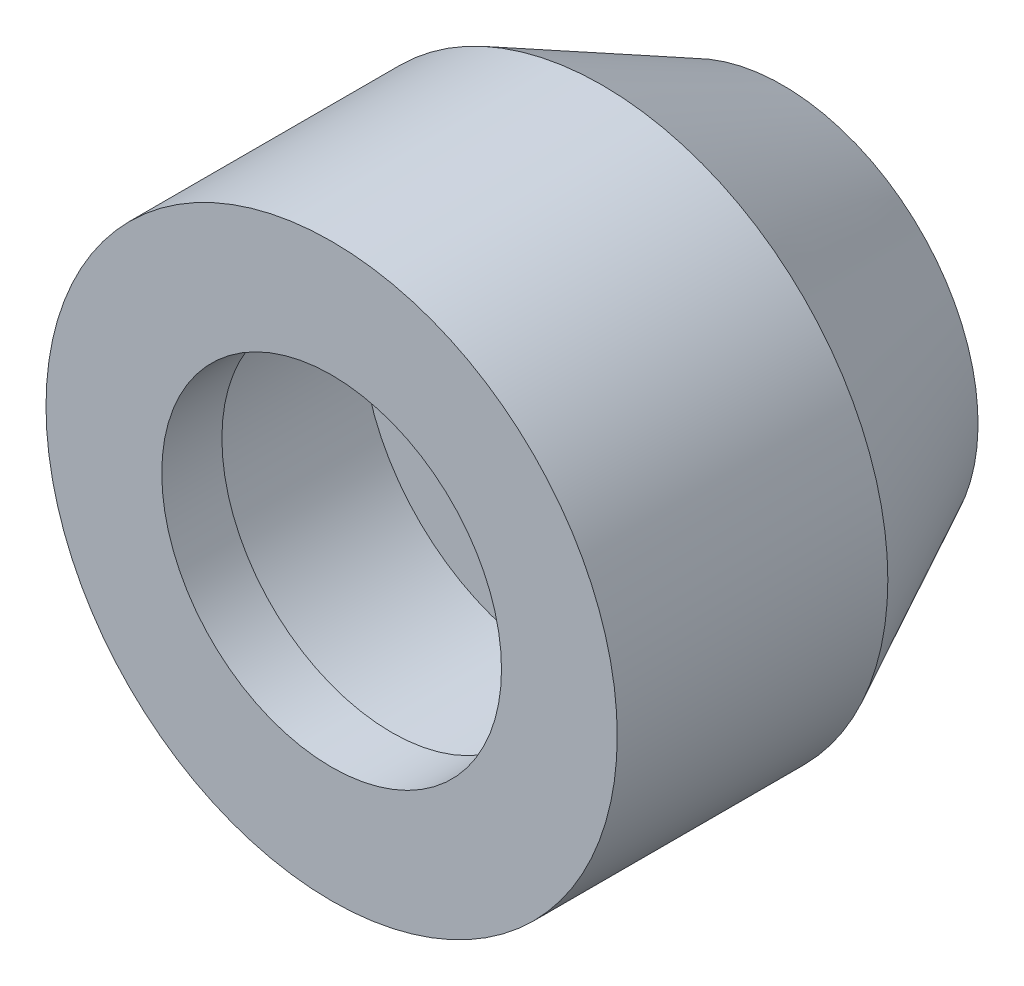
ISO-10303-21;
HEADER;
FILE_DESCRIPTION(('STEP AP214'),'2;1');
FILE_NAME('part.step','',(''),(''),'','','');
FILE_SCHEMA(('AUTOMOTIVE_DESIGN { 1 0 10303 214 1 1 1 1 }'));
ENDSEC;
DATA;
#1=APPLICATION_CONTEXT('core data for automotive mechanical design processes');
#2=APPLICATION_PROTOCOL_DEFINITION('international standard','automotive_design',2000,#1);
#3=PRODUCT_CONTEXT('',#1,'mechanical');
#4=PRODUCT('Part','Part','',(#3));
#5=PRODUCT_RELATED_PRODUCT_CATEGORY('part','',(#4));
#6=PRODUCT_DEFINITION_FORMATION('','',#4);
#7=PRODUCT_DEFINITION_CONTEXT('part definition',#1,'design');
#8=PRODUCT_DEFINITION('design','',#6,#7);
#9=PRODUCT_DEFINITION_SHAPE('','',#8);
#10=(LENGTH_UNIT() NAMED_UNIT(*) SI_UNIT(.MILLI.,.METRE.));
#11=(NAMED_UNIT(*) PLANE_ANGLE_UNIT() SI_UNIT($,.RADIAN.));
#12=(NAMED_UNIT(*) SI_UNIT($,.STERADIAN.) SOLID_ANGLE_UNIT());
#13=UNCERTAINTY_MEASURE_WITH_UNIT(LENGTH_MEASURE(1.E-05),#10,'distance_accuracy_value','');
#14=(GEOMETRIC_REPRESENTATION_CONTEXT(3) GLOBAL_UNCERTAINTY_ASSIGNED_CONTEXT((#13)) GLOBAL_UNIT_ASSIGNED_CONTEXT((#10,
#11,#12)) REPRESENTATION_CONTEXT('',''));
#15=CARTESIAN_POINT('',(0.,0.,0.));
#16=DIRECTION('',(0.,0.,1.));
#17=DIRECTION('',(1.,0.,0.));
#18=AXIS2_PLACEMENT_3D('',#15,#16,#17);
#19=CARTESIAN_POINT('',(0.,0.,7.5));
#20=DIRECTION('',(0.,0.,1.));
#21=DIRECTION('',(0.,-1.,0.));
#22=AXIS2_PLACEMENT_3D('',#19,#20,#21);
#23=PLANE('',#22);
#24=CARTESIAN_POINT('',(0.,0.,7.5));
#25=DIRECTION('',(0.,0.,1.));
#26=DIRECTION('',(0.,-1.,0.));
#27=AXIS2_PLACEMENT_3D('',#24,#25,#26);
#28=CIRCLE('',#27,6.5);
#29=CARTESIAN_POINT('',(0.,-6.5,7.5));
#30=VERTEX_POINT('',#29);
#31=EDGE_CURVE('E8',#30,#30,#28,.T.);
#32=ORIENTED_EDGE('',*,*,#31,.T.);
#33=EDGE_LOOP('',(#32));
#34=FACE_BOUND('',#33,.T.);
#35=ADVANCED_FACE('F12',(#34),#23,.T.);
#36=CARTESIAN_POINT('',(0.,0.,0.));
#37=DIRECTION('',(0.,0.,1.));
#38=DIRECTION('',(0.,-1.,0.));
#39=AXIS2_PLACEMENT_3D('',#36,#37,#38);
#40=CYLINDRICAL_SURFACE('',#39,6.5);
#41=CARTESIAN_POINT('',(0.,0.,13.));
#42=DIRECTION('',(0.,0.,1.));
#43=DIRECTION('',(0.,-1.,0.));
#44=AXIS2_PLACEMENT_3D('',#41,#42,#43);
#45=CIRCLE('',#44,6.5);
#46=CARTESIAN_POINT('',(0.,-6.5,13.));
#47=VERTEX_POINT('',#46);
#48=EDGE_CURVE('E18',#47,#47,#45,.T.);
#49=ORIENTED_EDGE('',*,*,#48,.T.);
#50=EDGE_LOOP('',(#49));
#51=FACE_BOUND('',#50,.T.);
#52=ORIENTED_EDGE('',*,*,#31,.F.);
#53=EDGE_LOOP('',(#52));
#54=FACE_BOUND('',#53,.T.);
#55=ADVANCED_FACE('F55',(#51,#54),#40,.F.);
#56=CARTESIAN_POINT('',(6.5,0.,13.));
#57=DIRECTION('',(0.,0.,-1.));
#58=DIRECTION('',(0.,1.,0.));
#59=AXIS2_PLACEMENT_3D('',#56,#57,#58);
#60=PLANE('',#59);
#61=CARTESIAN_POINT('',(0.,0.,13.));
#62=DIRECTION('',(0.,0.,1.));
#63=DIRECTION('',(0.,-1.,0.));
#64=AXIS2_PLACEMENT_3D('',#61,#62,#63);
#65=CIRCLE('',#64,5.65);
#66=CARTESIAN_POINT('',(0.,-5.65,13.));
#67=VERTEX_POINT('',#66);
#68=EDGE_CURVE('E22',#67,#67,#65,.T.);
#69=ORIENTED_EDGE('',*,*,#68,.T.);
#70=EDGE_LOOP('',(#69));
#71=FACE_BOUND('',#70,.T.);
#72=ORIENTED_EDGE('',*,*,#48,.F.);
#73=EDGE_LOOP('',(#72));
#74=FACE_BOUND('',#73,.T.);
#75=ADVANCED_FACE('F60',(#71,#74),#60,.T.);
#76=CARTESIAN_POINT('',(0.,0.,0.));
#77=DIRECTION('',(0.,0.,1.));
#78=DIRECTION('',(0.,-1.,0.));
#79=AXIS2_PLACEMENT_3D('',#76,#77,#78);
#80=CYLINDRICAL_SURFACE('',#79,5.65);
#81=CARTESIAN_POINT('',(0.,0.,15.));
#82=DIRECTION('',(0.,0.,1.));
#83=DIRECTION('',(0.,-1.,0.));
#84=AXIS2_PLACEMENT_3D('',#81,#82,#83);
#85=CIRCLE('',#84,5.65);
#86=CARTESIAN_POINT('',(0.,-5.65,15.));
#87=VERTEX_POINT('',#86);
#88=EDGE_CURVE('E26',#87,#87,#85,.T.);
#89=ORIENTED_EDGE('',*,*,#88,.T.);
#90=EDGE_LOOP('',(#89));
#91=FACE_BOUND('',#90,.T.);
#92=ORIENTED_EDGE('',*,*,#68,.F.);
#93=EDGE_LOOP('',(#92));
#94=FACE_BOUND('',#93,.T.);
#95=ADVANCED_FACE('F65',(#91,#94),#80,.F.);
#96=CARTESIAN_POINT('',(5.65,0.,15.));
#97=DIRECTION('',(0.,0.,1.));
#98=DIRECTION('',(0.,-1.,0.));
#99=AXIS2_PLACEMENT_3D('',#96,#97,#98);
#100=PLANE('',#99);
#101=CARTESIAN_POINT('',(0.,0.,15.));
#102=DIRECTION('',(0.,0.,1.));
#103=DIRECTION('',(0.,-1.,0.));
#104=AXIS2_PLACEMENT_3D('',#101,#102,#103);
#105=CIRCLE('',#104,9.5);
#106=CARTESIAN_POINT('',(0.,-9.5,15.));
#107=VERTEX_POINT('',#106);
#108=EDGE_CURVE('E31',#107,#107,#105,.T.);
#109=ORIENTED_EDGE('',*,*,#108,.T.);
#110=EDGE_LOOP('',(#109));
#111=FACE_BOUND('',#110,.T.);
#112=ORIENTED_EDGE('',*,*,#88,.F.);
#113=EDGE_LOOP('',(#112));
#114=FACE_BOUND('',#113,.T.);
#115=ADVANCED_FACE('F72',(#111,#114),#100,.T.);
#116=CARTESIAN_POINT('',(0.,0.,0.));
#117=DIRECTION('',(0.,0.,1.));
#118=DIRECTION('',(0.,-1.,0.));
#119=AXIS2_PLACEMENT_3D('',#116,#117,#118);
#120=CYLINDRICAL_SURFACE('',#119,9.5);
#121=CARTESIAN_POINT('',(0.,0.,6.));
#122=DIRECTION('',(0.,0.,1.));
#123=DIRECTION('',(0.,-1.,0.));
#124=AXIS2_PLACEMENT_3D('',#121,#122,#123);
#125=CIRCLE('',#124,9.5);
#126=CARTESIAN_POINT('',(0.,-9.5,6.));
#127=VERTEX_POINT('',#126);
#128=EDGE_CURVE('E34',#127,#127,#125,.T.);
#129=ORIENTED_EDGE('',*,*,#128,.T.);
#130=EDGE_LOOP('',(#129));
#131=FACE_BOUND('',#130,.T.);
#132=ORIENTED_EDGE('',*,*,#108,.F.);
#133=EDGE_LOOP('',(#132));
#134=FACE_BOUND('',#133,.T.);
#135=ADVANCED_FACE('F52',(#131,#134),#120,.T.);
#136=CARTESIAN_POINT('',(0.,0.,6.));
#137=DIRECTION('',(0.,0.,1.));
#138=DIRECTION('',(0.,-1.,0.));
#139=AXIS2_PLACEMENT_3D('',#136,#137,#138);
#140=CONICAL_SURFACE('',#139,9.5,0.463647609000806);
#141=CARTESIAN_POINT('',(0.,0.,0.));
#142=DIRECTION('',(0.,0.,1.));
#143=DIRECTION('',(0.,-1.,0.));
#144=AXIS2_PLACEMENT_3D('',#141,#142,#143);
#145=CIRCLE('',#144,6.5);
#146=CARTESIAN_POINT('',(0.,-6.5,0.));
#147=VERTEX_POINT('',#146);
#148=EDGE_CURVE('E37',#147,#147,#145,.T.);
#149=ORIENTED_EDGE('',*,*,#148,.T.);
#150=EDGE_LOOP('',(#149));
#151=FACE_BOUND('',#150,.T.);
#152=ORIENTED_EDGE('',*,*,#128,.F.);
#153=EDGE_LOOP('',(#152));
#154=FACE_BOUND('',#153,.T.);
#155=ADVANCED_FACE('F41',(#151,#154),#140,.T.);
#156=CARTESIAN_POINT('',(6.5,0.,0.));
#157=DIRECTION('',(0.,0.,-1.));
#158=DIRECTION('',(0.,1.,0.));
#159=AXIS2_PLACEMENT_3D('',#156,#157,#158);
#160=PLANE('',#159);
#161=ORIENTED_EDGE('',*,*,#148,.F.);
#162=EDGE_LOOP('',(#161));
#163=FACE_BOUND('',#162,.T.);
#164=ADVANCED_FACE('F44',(#163),#160,.T.);
#165=CLOSED_SHELL('',(#35,#55,#75,#95,#115,#135,#155,#164));
#166=MANIFOLD_SOLID_BREP('B1',#165);
#167=ADVANCED_BREP_SHAPE_REPRESENTATION('',(#18,#166),#14);
#168=SHAPE_DEFINITION_REPRESENTATION(#9,#167);
ENDSEC;
END-ISO-10303-21;
